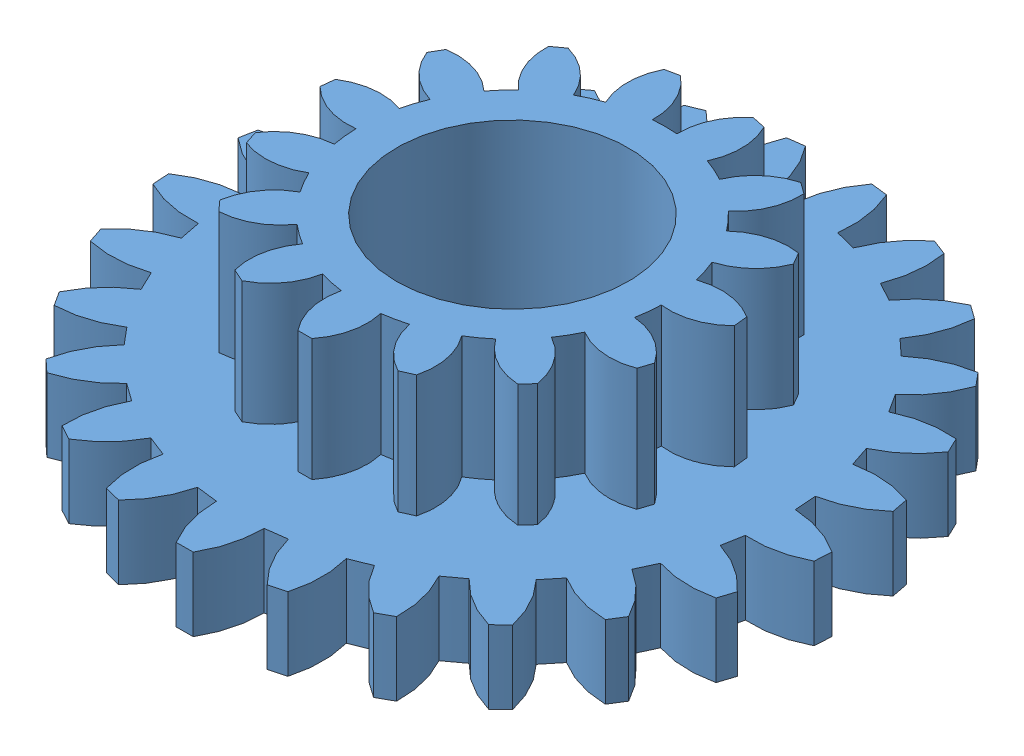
SolidWorks assembly SubEnsambleEngranaje.SLDASM, configuration Predeterminado (file format 10000). Lengths in mm.
Overall size (37.25 8 37.26).
2 component instances, 1 part files, 2 mates.
Components (placement in the parent):
- EngranajeParametrico-1: EngranajeParametrico.SLDPRT [15_interior_circulo] at (-3.7001 1.8703 26.9476) size (16.96 8 16.87)
- EngranajeParametrico-2: EngranajeParametrico.SLDPRT [25_exterior] at (-3.7001 1.8703 26.9476) x (0.540996 0 0.841025) z (-0.841025 0 0.540996) size (26.98 3 26.93)
Mates (geometry in assembly coordinates):
- Concéntrica1: concentric aligned: cylinder of EngranajeParametrico-1 through (-3.7001 -11.5461 26.9476) axis (0 1 0) radius 4.7434; cylinder of EngranajeParametrico-2 through (-3.7001 -1.6749 26.9476) axis (0 1 0) radius 11.25
- Coincidente2: coincident aligned: plane of EngranajeParametrico-1 through (-3.7001 1.8703 26.9476) normal (0 -1 0); plane of EngranajeParametrico-2 through (-3.7001 1.8703 26.9476) normal (0 -1 0)
